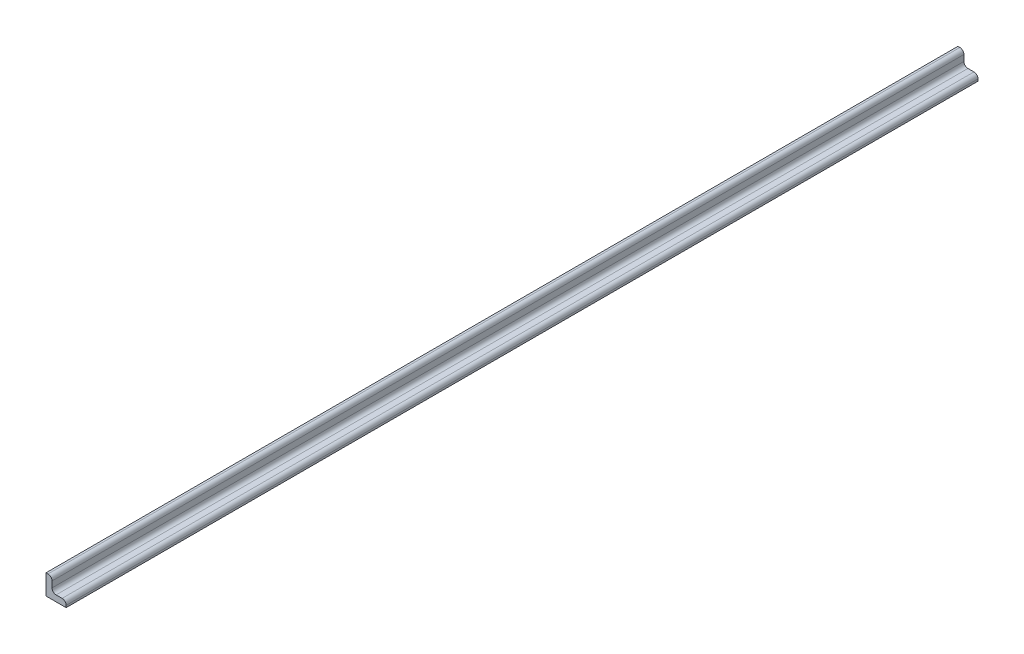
ISO-10303-21;
HEADER;
FILE_DESCRIPTION(('STEP AP214'),'2;1');
FILE_NAME('part.step','',(''),(''),'','','');
FILE_SCHEMA(('AUTOMOTIVE_DESIGN { 1 0 10303 214 1 1 1 1 }'));
ENDSEC;
DATA;
#1=APPLICATION_CONTEXT('core data for automotive mechanical design processes');
#2=APPLICATION_PROTOCOL_DEFINITION('international standard','automotive_design',2000,#1);
#3=PRODUCT_CONTEXT('',#1,'mechanical');
#4=PRODUCT('Part','Part','',(#3));
#5=PRODUCT_RELATED_PRODUCT_CATEGORY('part','',(#4));
#6=PRODUCT_DEFINITION_FORMATION('','',#4);
#7=PRODUCT_DEFINITION_CONTEXT('part definition',#1,'design');
#8=PRODUCT_DEFINITION('design','',#6,#7);
#9=PRODUCT_DEFINITION_SHAPE('','',#8);
#10=(LENGTH_UNIT() NAMED_UNIT(*) SI_UNIT(.MILLI.,.METRE.));
#11=(NAMED_UNIT(*) PLANE_ANGLE_UNIT() SI_UNIT($,.RADIAN.));
#12=(NAMED_UNIT(*) SI_UNIT($,.STERADIAN.) SOLID_ANGLE_UNIT());
#13=UNCERTAINTY_MEASURE_WITH_UNIT(LENGTH_MEASURE(1.E-05),#10,'distance_accuracy_value','');
#14=(GEOMETRIC_REPRESENTATION_CONTEXT(3) GLOBAL_UNCERTAINTY_ASSIGNED_CONTEXT((#13)) GLOBAL_UNIT_ASSIGNED_CONTEXT((#10,
#11,#12)) REPRESENTATION_CONTEXT('',''));
#15=CARTESIAN_POINT('',(0.,0.,0.));
#16=DIRECTION('',(0.,0.,1.));
#17=DIRECTION('',(1.,0.,0.));
#18=AXIS2_PLACEMENT_3D('',#15,#16,#17);
#19=CARTESIAN_POINT('',(-1.94289029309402E-13,9.99999999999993,453.));
#20=DIRECTION('',(0.,1.,0.));
#21=DIRECTION('',(0.,0.,1.));
#22=AXIS2_PLACEMENT_3D('',#19,#20,#21);
#23=PLANE('',#22);
#24=DIRECTION('',(0.,0.,-1.));
#25=VECTOR('',#24,1.);
#26=CARTESIAN_POINT('',(-1.94289029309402E-13,9.99999999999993,453.));
#27=LINE('',#26,#25);
#28=CARTESIAN_POINT('',(-1.94289029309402E-13,9.99999999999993,453.));
#29=VERTEX_POINT('',#28);
#30=CARTESIAN_POINT('',(0.,10.,0.));
#31=VERTEX_POINT('',#30);
#32=EDGE_CURVE('E11',#29,#31,#27,.T.);
#33=ORIENTED_EDGE('',*,*,#32,.F.);
#34=DIRECTION('',(1.,0.,0.));
#35=VECTOR('',#34,1.);
#36=CARTESIAN_POINT('',(-1.94289029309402E-13,9.99999999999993,453.));
#37=LINE('',#36,#35);
#38=CARTESIAN_POINT('',(0.999999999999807,9.9999999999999,453.));
#39=VERTEX_POINT('',#38);
#40=EDGE_CURVE('E103',#29,#39,#37,.T.);
#41=ORIENTED_EDGE('',*,*,#40,.T.);
#42=DIRECTION('',(0.,0.,-1.));
#43=VECTOR('',#42,1.);
#44=CARTESIAN_POINT('',(0.999999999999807,9.9999999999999,453.));
#45=LINE('',#44,#43);
#46=CARTESIAN_POINT('',(1.,9.99999999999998,0.));
#47=VERTEX_POINT('',#46);
#48=EDGE_CURVE('E99',#39,#47,#45,.T.);
#49=ORIENTED_EDGE('',*,*,#48,.T.);
#50=DIRECTION('',(1.,0.,0.));
#51=VECTOR('',#50,1.);
#52=CARTESIAN_POINT('',(0.,10.,0.));
#53=LINE('',#52,#51);
#54=EDGE_CURVE('E101',#31,#47,#53,.T.);
#55=ORIENTED_EDGE('',*,*,#54,.F.);
#56=EDGE_LOOP('',(#33,#41,#49,#55));
#57=FACE_BOUND('',#56,.T.);
#58=ADVANCED_FACE('F32',(#57),#23,.T.);
#59=CARTESIAN_POINT('',(-1.94289029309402E-13,9.99999999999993,453.));
#60=DIRECTION('',(1.,0.,0.));
#61=DIRECTION('',(0.,1.,0.));
#62=AXIS2_PLACEMENT_3D('',#59,#60,#61);
#63=PLANE('',#62);
#64=DIRECTION('',(0.,0.,-1.));
#65=VECTOR('',#64,1.);
#66=CARTESIAN_POINT('',(-1.38777878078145E-13,-1.11022302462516E-13,453.));
#67=LINE('',#66,#65);
#68=CARTESIAN_POINT('',(-1.38777878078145E-13,-1.11022302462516E-13,453.));
#69=VERTEX_POINT('',#68);
#70=CARTESIAN_POINT('',(0.,0.,0.));
#71=VERTEX_POINT('',#70);
#72=EDGE_CURVE('E40',#69,#71,#67,.T.);
#73=ORIENTED_EDGE('',*,*,#72,.F.);
#74=DIRECTION('',(0.,-1.,0.));
#75=VECTOR('',#74,1.);
#76=CARTESIAN_POINT('',(-1.94289029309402E-13,9.99999999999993,453.));
#77=LINE('',#76,#75);
#78=EDGE_CURVE('E109',#29,#69,#77,.T.);
#79=ORIENTED_EDGE('',*,*,#78,.F.);
#80=ORIENTED_EDGE('',*,*,#32,.T.);
#81=DIRECTION('',(0.,-1.,0.));
#82=VECTOR('',#81,1.);
#83=CARTESIAN_POINT('',(0.,10.,0.));
#84=LINE('',#83,#82);
#85=EDGE_CURVE('E118',#31,#71,#84,.T.);
#86=ORIENTED_EDGE('',*,*,#85,.T.);
#87=EDGE_LOOP('',(#73,#79,#80,#86));
#88=FACE_BOUND('',#87,.T.);
#89=ADVANCED_FACE('F34',(#88),#63,.F.);
#90=CARTESIAN_POINT('',(-1.38777878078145E-13,-1.11022302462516E-13,453.));
#91=DIRECTION('',(0.,1.,0.));
#92=DIRECTION('',(0.,0.,1.));
#93=AXIS2_PLACEMENT_3D('',#90,#91,#92);
#94=PLANE('',#93);
#95=DIRECTION('',(0.,0.,-1.));
#96=VECTOR('',#95,1.);
#97=CARTESIAN_POINT('',(9.99999999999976,-1.94289029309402E-13,453.));
#98=LINE('',#97,#96);
#99=CARTESIAN_POINT('',(9.99999999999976,-1.94289029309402E-13,453.));
#100=VERTEX_POINT('',#99);
#101=CARTESIAN_POINT('',(10.,0.,0.));
#102=VERTEX_POINT('',#101);
#103=EDGE_CURVE('E173',#100,#102,#98,.T.);
#104=ORIENTED_EDGE('',*,*,#103,.F.);
#105=DIRECTION('',(1.,0.,0.));
#106=VECTOR('',#105,1.);
#107=CARTESIAN_POINT('',(-1.38777878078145E-13,-1.11022302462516E-13,453.));
#108=LINE('',#107,#106);
#109=EDGE_CURVE('E159',#69,#100,#108,.T.);
#110=ORIENTED_EDGE('',*,*,#109,.F.);
#111=ORIENTED_EDGE('',*,*,#72,.T.);
#112=DIRECTION('',(1.,0.,0.));
#113=VECTOR('',#112,1.);
#114=CARTESIAN_POINT('',(0.,0.,0.));
#115=LINE('',#114,#113);
#116=EDGE_CURVE('E137',#71,#102,#115,.T.);
#117=ORIENTED_EDGE('',*,*,#116,.T.);
#118=EDGE_LOOP('',(#104,#110,#111,#117));
#119=FACE_BOUND('',#118,.T.);
#120=ADVANCED_FACE('F175',(#119),#94,.F.);
#121=CARTESIAN_POINT('',(9.99999999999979,0.999999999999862,453.));
#122=DIRECTION('',(1.,0.,0.));
#123=DIRECTION('',(0.,1.,0.));
#124=AXIS2_PLACEMENT_3D('',#121,#122,#123);
#125=PLANE('',#124);
#126=DIRECTION('',(0.,0.,-1.));
#127=VECTOR('',#126,1.);
#128=CARTESIAN_POINT('',(9.99999999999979,0.999999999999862,453.));
#129=LINE('',#128,#127);
#130=CARTESIAN_POINT('',(9.99999999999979,0.999999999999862,453.));
#131=VERTEX_POINT('',#130);
#132=CARTESIAN_POINT('',(10.,0.999999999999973,0.));
#133=VERTEX_POINT('',#132);
#134=EDGE_CURVE('E171',#131,#133,#129,.T.);
#135=ORIENTED_EDGE('',*,*,#134,.F.);
#136=DIRECTION('',(0.,-1.,0.));
#137=VECTOR('',#136,1.);
#138=CARTESIAN_POINT('',(9.99999999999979,0.999999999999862,453.));
#139=LINE('',#138,#137);
#140=EDGE_CURVE('E156',#131,#100,#139,.T.);
#141=ORIENTED_EDGE('',*,*,#140,.T.);
#142=ORIENTED_EDGE('',*,*,#103,.T.);
#143=DIRECTION('',(0.,-1.,0.));
#144=VECTOR('',#143,1.);
#145=CARTESIAN_POINT('',(10.,0.999999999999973,0.));
#146=LINE('',#145,#144);
#147=EDGE_CURVE('E134',#133,#102,#146,.T.);
#148=ORIENTED_EDGE('',*,*,#147,.F.);
#149=EDGE_LOOP('',(#135,#141,#142,#148));
#150=FACE_BOUND('',#149,.T.);
#151=ADVANCED_FACE('F196',(#150),#125,.T.);
#152=CARTESIAN_POINT('',(7.99999999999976,0.999999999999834,453.));
#153=DIRECTION('',(0.,0.,-1.));
#154=DIRECTION('',(-1.,0.,0.));
#155=AXIS2_PLACEMENT_3D('',#152,#153,#154);
#156=CYLINDRICAL_SURFACE('',#155,2.);
#157=DIRECTION('',(0.,0.,-1.));
#158=VECTOR('',#157,1.);
#159=CARTESIAN_POINT('',(7.99999999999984,2.99999999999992,453.));
#160=LINE('',#159,#158);
#161=CARTESIAN_POINT('',(7.99999999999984,2.99999999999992,453.));
#162=VERTEX_POINT('',#161);
#163=CARTESIAN_POINT('',(7.99999999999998,3.,0.));
#164=VERTEX_POINT('',#163);
#165=EDGE_CURVE('E169',#162,#164,#160,.T.);
#166=ORIENTED_EDGE('',*,*,#165,.F.);
#167=CARTESIAN_POINT('',(7.99999999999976,0.999999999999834,453.));
#168=DIRECTION('',(0.,0.,1.));
#169=DIRECTION('',(1.,0.,0.));
#170=AXIS2_PLACEMENT_3D('',#167,#168,#169);
#171=CIRCLE('',#170,2.);
#172=EDGE_CURVE('E153',#131,#162,#171,.T.);
#173=ORIENTED_EDGE('',*,*,#172,.F.);
#174=ORIENTED_EDGE('',*,*,#134,.T.);
#175=CARTESIAN_POINT('',(8.00000000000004,1.,0.));
#176=DIRECTION('',(0.,0.,1.));
#177=DIRECTION('',(1.,0.,0.));
#178=AXIS2_PLACEMENT_3D('',#175,#176,#177);
#179=CIRCLE('',#178,2.);
#180=EDGE_CURVE('E131',#133,#164,#179,.T.);
#181=ORIENTED_EDGE('',*,*,#180,.T.);
#182=EDGE_LOOP('',(#166,#173,#174,#181));
#183=FACE_BOUND('',#182,.T.);
#184=ADVANCED_FACE('F193',(#183),#156,.T.);
#185=CARTESIAN_POINT('',(4.99999999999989,2.99999999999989,453.));
#186=DIRECTION('',(0.,1.,0.));
#187=DIRECTION('',(-1.,0.,0.));
#188=AXIS2_PLACEMENT_3D('',#185,#186,#187);
#189=PLANE('',#188);
#190=DIRECTION('',(0.,0.,-1.));
#191=VECTOR('',#190,1.);
#192=CARTESIAN_POINT('',(4.99999999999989,2.99999999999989,453.));
#193=LINE('',#192,#191);
#194=CARTESIAN_POINT('',(4.99999999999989,2.99999999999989,453.));
#195=VERTEX_POINT('',#194);
#196=CARTESIAN_POINT('',(5.00000000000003,3.,0.));
#197=VERTEX_POINT('',#196);
#198=EDGE_CURVE('E167',#195,#197,#193,.T.);
#199=ORIENTED_EDGE('',*,*,#198,.F.);
#200=DIRECTION('',(1.,0.,0.));
#201=VECTOR('',#200,1.);
#202=CARTESIAN_POINT('',(4.99999999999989,2.99999999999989,453.));
#203=LINE('',#202,#201);
#204=EDGE_CURVE('E150',#195,#162,#203,.T.);
#205=ORIENTED_EDGE('',*,*,#204,.T.);
#206=ORIENTED_EDGE('',*,*,#165,.T.);
#207=DIRECTION('',(1.,0.,0.));
#208=VECTOR('',#207,1.);
#209=CARTESIAN_POINT('',(5.00000000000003,3.,0.));
#210=LINE('',#209,#208);
#211=EDGE_CURVE('E128',#197,#164,#210,.T.);
#212=ORIENTED_EDGE('',*,*,#211,.F.);
#213=EDGE_LOOP('',(#199,#205,#206,#212));
#214=FACE_BOUND('',#213,.T.);
#215=ADVANCED_FACE('F191',(#214),#189,.T.);
#216=CARTESIAN_POINT('',(4.99999999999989,4.99999999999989,453.));
#217=DIRECTION('',(0.,0.,-1.));
#218=DIRECTION('',(-1.,0.,0.));
#219=AXIS2_PLACEMENT_3D('',#216,#217,#218);
#220=CYLINDRICAL_SURFACE('',#219,2.);
#221=DIRECTION('',(0.,0.,-1.));
#222=VECTOR('',#221,1.);
#223=CARTESIAN_POINT('',(2.99999999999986,4.99999999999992,453.));
#224=LINE('',#223,#222);
#225=CARTESIAN_POINT('',(2.99999999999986,4.99999999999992,453.));
#226=VERTEX_POINT('',#225);
#227=CARTESIAN_POINT('',(3.00000000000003,5.,0.));
#228=VERTEX_POINT('',#227);
#229=EDGE_CURVE('E165',#226,#228,#224,.T.);
#230=ORIENTED_EDGE('',*,*,#229,.F.);
#231=CARTESIAN_POINT('',(4.99999999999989,4.99999999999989,453.));
#232=DIRECTION('',(0.,0.,-1.));
#233=DIRECTION('',(-1.,0.,0.));
#234=AXIS2_PLACEMENT_3D('',#231,#232,#233);
#235=CIRCLE('',#234,2.);
#236=EDGE_CURVE('E147',#195,#226,#235,.T.);
#237=ORIENTED_EDGE('',*,*,#236,.F.);
#238=ORIENTED_EDGE('',*,*,#198,.T.);
#239=CARTESIAN_POINT('',(5.,4.99999999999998,0.));
#240=DIRECTION('',(0.,0.,-1.));
#241=DIRECTION('',(-1.,0.,0.));
#242=AXIS2_PLACEMENT_3D('',#239,#240,#241);
#243=CIRCLE('',#242,2.);
#244=EDGE_CURVE('E123',#197,#228,#243,.T.);
#245=ORIENTED_EDGE('',*,*,#244,.T.);
#246=EDGE_LOOP('',(#230,#237,#238,#245));
#247=FACE_BOUND('',#246,.T.);
#248=ADVANCED_FACE('F189',(#247),#220,.F.);
#249=CARTESIAN_POINT('',(2.99999999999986,7.9999999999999,453.));
#250=DIRECTION('',(1.,0.,0.));
#251=DIRECTION('',(0.,1.,0.));
#252=AXIS2_PLACEMENT_3D('',#249,#250,#251);
#253=PLANE('',#252);
#254=DIRECTION('',(0.,0.,-1.));
#255=VECTOR('',#254,1.);
#256=CARTESIAN_POINT('',(2.99999999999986,7.9999999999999,453.));
#257=LINE('',#256,#255);
#258=CARTESIAN_POINT('',(2.99999999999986,7.9999999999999,453.));
#259=VERTEX_POINT('',#258);
#260=CARTESIAN_POINT('',(3.,7.99999999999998,0.));
#261=VERTEX_POINT('',#260);
#262=EDGE_CURVE('E108',#259,#261,#257,.T.);
#263=ORIENTED_EDGE('',*,*,#262,.F.);
#264=DIRECTION('',(0.,-1.,0.));
#265=VECTOR('',#264,1.);
#266=CARTESIAN_POINT('',(2.99999999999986,7.9999999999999,453.));
#267=LINE('',#266,#265);
#268=EDGE_CURVE('E144',#259,#226,#267,.T.);
#269=ORIENTED_EDGE('',*,*,#268,.T.);
#270=ORIENTED_EDGE('',*,*,#229,.T.);
#271=DIRECTION('',(0.,-1.,0.));
#272=VECTOR('',#271,1.);
#273=CARTESIAN_POINT('',(3.,7.99999999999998,0.));
#274=LINE('',#273,#272);
#275=EDGE_CURVE('E121',#261,#228,#274,.T.);
#276=ORIENTED_EDGE('',*,*,#275,.F.);
#277=EDGE_LOOP('',(#263,#269,#270,#276));
#278=FACE_BOUND('',#277,.T.);
#279=ADVANCED_FACE('F185',(#278),#253,.T.);
#280=CARTESIAN_POINT('',(0.999999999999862,7.9999999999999,453.));
#281=DIRECTION('',(0.,0.,-1.));
#282=DIRECTION('',(-1.,0.,0.));
#283=AXIS2_PLACEMENT_3D('',#280,#281,#282);
#284=CYLINDRICAL_SURFACE('',#283,2.);
#285=CARTESIAN_POINT('',(0.999999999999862,7.9999999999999,453.));
#286=DIRECTION('',(0.,0.,1.));
#287=DIRECTION('',(1.,0.,0.));
#288=AXIS2_PLACEMENT_3D('',#285,#286,#287);
#289=CIRCLE('',#288,2.);
#290=EDGE_CURVE('E142',#259,#39,#289,.T.);
#291=ORIENTED_EDGE('',*,*,#290,.F.);
#292=ORIENTED_EDGE('',*,*,#262,.T.);
#293=CARTESIAN_POINT('',(1.,7.99999999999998,0.));
#294=DIRECTION('',(0.,0.,1.));
#295=DIRECTION('',(1.,0.,0.));
#296=AXIS2_PLACEMENT_3D('',#293,#294,#295);
#297=CIRCLE('',#296,2.);
#298=EDGE_CURVE('E115',#261,#47,#297,.T.);
#299=ORIENTED_EDGE('',*,*,#298,.T.);
#300=ORIENTED_EDGE('',*,*,#48,.F.);
#301=EDGE_LOOP('',(#291,#292,#299,#300));
#302=FACE_BOUND('',#301,.T.);
#303=ADVANCED_FACE('F120',(#302),#284,.T.);
#304=CARTESIAN_POINT('',(0.999999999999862,7.9999999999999,453.));
#305=DIRECTION('',(0.,0.,1.));
#306=DIRECTION('',(1.,0.,0.));
#307=AXIS2_PLACEMENT_3D('',#304,#305,#306);
#308=PLANE('',#307);
#309=ORIENTED_EDGE('',*,*,#40,.F.);
#310=ORIENTED_EDGE('',*,*,#78,.T.);
#311=ORIENTED_EDGE('',*,*,#109,.T.);
#312=ORIENTED_EDGE('',*,*,#140,.F.);
#313=ORIENTED_EDGE('',*,*,#172,.T.);
#314=ORIENTED_EDGE('',*,*,#204,.F.);
#315=ORIENTED_EDGE('',*,*,#236,.T.);
#316=ORIENTED_EDGE('',*,*,#268,.F.);
#317=ORIENTED_EDGE('',*,*,#290,.T.);
#318=EDGE_LOOP('',(#309,#310,#311,#312,#313,#314,#315,#316,#317));
#319=FACE_BOUND('',#318,.T.);
#320=ADVANCED_FACE('F179',(#319),#308,.T.);
#321=CARTESIAN_POINT('',(1.,7.99999999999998,0.));
#322=DIRECTION('',(0.,0.,1.));
#323=DIRECTION('',(1.,0.,0.));
#324=AXIS2_PLACEMENT_3D('',#321,#322,#323);
#325=PLANE('',#324);
#326=ORIENTED_EDGE('',*,*,#54,.T.);
#327=ORIENTED_EDGE('',*,*,#298,.F.);
#328=ORIENTED_EDGE('',*,*,#275,.T.);
#329=ORIENTED_EDGE('',*,*,#244,.F.);
#330=ORIENTED_EDGE('',*,*,#211,.T.);
#331=ORIENTED_EDGE('',*,*,#180,.F.);
#332=ORIENTED_EDGE('',*,*,#147,.T.);
#333=ORIENTED_EDGE('',*,*,#116,.F.);
#334=ORIENTED_EDGE('',*,*,#85,.F.);
#335=EDGE_LOOP('',(#326,#327,#328,#329,#330,#331,#332,#333,#334));
#336=FACE_BOUND('',#335,.T.);
#337=ADVANCED_FACE('F113',(#336),#325,.F.);
#338=CLOSED_SHELL('',(#58,#89,#120,#151,#184,#215,#248,#279,#303,#320,#337));
#339=MANIFOLD_SOLID_BREP('B2',#338);
#340=ADVANCED_BREP_SHAPE_REPRESENTATION('',(#18,#339),#14);
#341=SHAPE_DEFINITION_REPRESENTATION(#9,#340);
ENDSEC;
END-ISO-10303-21;
